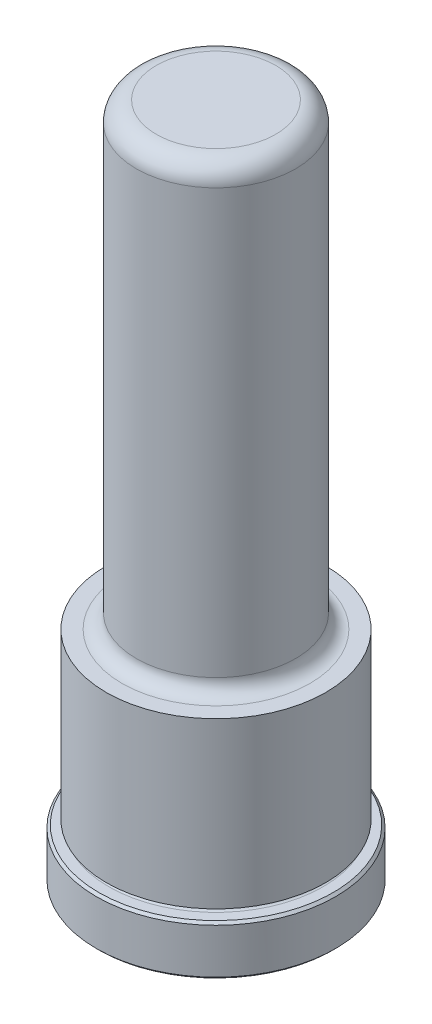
ISO-10303-21;
HEADER;
FILE_DESCRIPTION(('STEP AP214'),'2;1');
FILE_NAME('part.step','',(''),(''),'','','');
FILE_SCHEMA(('AUTOMOTIVE_DESIGN { 1 0 10303 214 1 1 1 1 }'));
ENDSEC;
DATA;
#1=APPLICATION_CONTEXT('core data for automotive mechanical design processes');
#2=APPLICATION_PROTOCOL_DEFINITION('international standard','automotive_design',2000,#1);
#3=PRODUCT_CONTEXT('',#1,'mechanical');
#4=PRODUCT('Part','Part','',(#3));
#5=PRODUCT_RELATED_PRODUCT_CATEGORY('part','',(#4));
#6=PRODUCT_DEFINITION_FORMATION('','',#4);
#7=PRODUCT_DEFINITION_CONTEXT('part definition',#1,'design');
#8=PRODUCT_DEFINITION('design','',#6,#7);
#9=PRODUCT_DEFINITION_SHAPE('','',#8);
#10=(LENGTH_UNIT() NAMED_UNIT(*) SI_UNIT(.MILLI.,.METRE.));
#11=(NAMED_UNIT(*) PLANE_ANGLE_UNIT() SI_UNIT($,.RADIAN.));
#12=(NAMED_UNIT(*) SI_UNIT($,.STERADIAN.) SOLID_ANGLE_UNIT());
#13=UNCERTAINTY_MEASURE_WITH_UNIT(LENGTH_MEASURE(1.E-05),#10,'distance_accuracy_value','');
#14=(GEOMETRIC_REPRESENTATION_CONTEXT(3) GLOBAL_UNCERTAINTY_ASSIGNED_CONTEXT((#13)) GLOBAL_UNIT_ASSIGNED_CONTEXT((#10,
#11,#12)) REPRESENTATION_CONTEXT('',''));
#15=CARTESIAN_POINT('',(0.,0.,0.));
#16=DIRECTION('',(0.,0.,1.));
#17=DIRECTION('',(1.,0.,0.));
#18=AXIS2_PLACEMENT_3D('',#15,#16,#17);
#19=CARTESIAN_POINT('',(0.,0.,0.));
#20=DIRECTION('',(0.,1.,0.));
#21=DIRECTION('',(0.,0.,1.));
#22=AXIS2_PLACEMENT_3D('',#19,#20,#21);
#23=PLANE('',#22);
#24=CARTESIAN_POINT('',(0.,0.,0.));
#25=DIRECTION('',(0.,1.,0.));
#26=DIRECTION('',(0.,0.,1.));
#27=AXIS2_PLACEMENT_3D('',#24,#25,#26);
#28=CIRCLE('',#27,18.669);
#29=CARTESIAN_POINT('',(0.,0.,18.669));
#30=VERTEX_POINT('',#29);
#31=EDGE_CURVE('E46',#30,#30,#28,.F.);
#32=ORIENTED_EDGE('',*,*,#31,.T.);
#33=EDGE_LOOP('',(#32));
#34=FACE_BOUND('',#33,.T.);
#35=ADVANCED_FACE('F31',(#34),#23,.F.);
#36=CARTESIAN_POINT('',(0.,0.,0.));
#37=DIRECTION('',(0.,1.,0.));
#38=DIRECTION('',(0.,0.,1.));
#39=AXIS2_PLACEMENT_3D('',#36,#37,#38);
#40=CYLINDRICAL_SURFACE('',#39,19.05);
#41=CARTESIAN_POINT('',(0.,0.380999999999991,0.));
#42=DIRECTION('',(0.,1.,0.));
#43=DIRECTION('',(0.,0.,1.));
#44=AXIS2_PLACEMENT_3D('',#41,#42,#43);
#45=CIRCLE('',#44,19.05);
#46=CARTESIAN_POINT('',(0.,0.380999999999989,19.05));
#47=VERTEX_POINT('',#46);
#48=EDGE_CURVE('E51',#47,#47,#45,.T.);
#49=ORIENTED_EDGE('',*,*,#48,.T.);
#50=EDGE_LOOP('',(#49));
#51=FACE_BOUND('',#50,.T.);
#52=CARTESIAN_POINT('',(0.,7.5438,0.));
#53=DIRECTION('',(0.,-1.,0.));
#54=DIRECTION('',(0.,0.,-1.));
#55=AXIS2_PLACEMENT_3D('',#52,#53,#54);
#56=CIRCLE('',#55,19.05);
#57=CARTESIAN_POINT('',(0.,7.5438,-19.05));
#58=VERTEX_POINT('',#57);
#59=EDGE_CURVE('E54',#58,#58,#56,.T.);
#60=ORIENTED_EDGE('',*,*,#59,.T.);
#61=EDGE_LOOP('',(#60));
#62=FACE_BOUND('',#61,.T.);
#63=ADVANCED_FACE('F110',(#51,#62),#40,.T.);
#64=CARTESIAN_POINT('',(0.,7.9248,-19.05));
#65=DIRECTION('',(0.,-1.,0.));
#66=DIRECTION('',(0.,0.,-1.));
#67=AXIS2_PLACEMENT_3D('',#64,#65,#66);
#68=PLANE('',#67);
#69=CARTESIAN_POINT('',(0.,7.9248,0.));
#70=DIRECTION('',(0.,-1.,0.));
#71=DIRECTION('',(0.,0.,-1.));
#72=AXIS2_PLACEMENT_3D('',#69,#70,#71);
#73=CIRCLE('',#72,18.669);
#74=CARTESIAN_POINT('',(0.,7.9248,-18.669));
#75=VERTEX_POINT('',#74);
#76=EDGE_CURVE('E42',#75,#75,#73,.F.);
#77=ORIENTED_EDGE('',*,*,#76,.T.);
#78=EDGE_LOOP('',(#77));
#79=FACE_BOUND('',#78,.T.);
#80=CARTESIAN_POINT('',(0.,7.9248,0.));
#81=DIRECTION('',(0.,1.,0.));
#82=DIRECTION('',(0.,0.,1.));
#83=AXIS2_PLACEMENT_3D('',#80,#81,#82);
#84=CIRCLE('',#83,17.0688);
#85=CARTESIAN_POINT('',(0.,7.92479999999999,17.0688));
#86=VERTEX_POINT('',#85);
#87=EDGE_CURVE('E57',#86,#86,#84,.T.);
#88=ORIENTED_EDGE('',*,*,#87,.F.);
#89=EDGE_LOOP('',(#88));
#90=FACE_BOUND('',#89,.T.);
#91=ADVANCED_FACE('F105',(#79,#90),#68,.F.);
#92=CARTESIAN_POINT('',(0.,8.3058,0.));
#93=DIRECTION('',(0.,1.,0.));
#94=DIRECTION('',(0.,0.,1.));
#95=AXIS2_PLACEMENT_3D('',#92,#93,#94);
#96=TOROIDAL_SURFACE('',#95,17.0688,0.381000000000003);
#97=CARTESIAN_POINT('',(0.,8.6868,0.));
#98=DIRECTION('',(0.,1.,0.));
#99=DIRECTION('',(0.,0.,1.));
#100=AXIS2_PLACEMENT_3D('',#97,#98,#99);
#101=CIRCLE('',#100,17.0688);
#102=CARTESIAN_POINT('',(0.,8.6868,17.0688));
#103=VERTEX_POINT('',#102);
#104=EDGE_CURVE('E60',#103,#103,#101,.T.);
#105=ORIENTED_EDGE('',*,*,#104,.F.);
#106=EDGE_LOOP('',(#105));
#107=FACE_BOUND('',#106,.T.);
#108=ORIENTED_EDGE('',*,*,#87,.T.);
#109=EDGE_LOOP('',(#108));
#110=FACE_BOUND('',#109,.T.);
#111=ADVANCED_FACE('F99',(#107,#110),#96,.F.);
#112=CARTESIAN_POINT('',(0.,8.6868,-17.0688));
#113=DIRECTION('',(0.,1.,0.));
#114=DIRECTION('',(0.,0.,1.));
#115=AXIS2_PLACEMENT_3D('',#112,#113,#114);
#116=PLANE('',#115);
#117=CARTESIAN_POINT('',(0.,8.6868,0.));
#118=DIRECTION('',(0.,1.,0.));
#119=DIRECTION('',(0.,0.,1.));
#120=AXIS2_PLACEMENT_3D('',#117,#118,#119);
#121=CIRCLE('',#120,17.4752);
#122=CARTESIAN_POINT('',(0.,8.6868,17.4752));
#123=VERTEX_POINT('',#122);
#124=EDGE_CURVE('E63',#123,#123,#121,.T.);
#125=ORIENTED_EDGE('',*,*,#124,.F.);
#126=EDGE_LOOP('',(#125));
#127=FACE_BOUND('',#126,.T.);
#128=ORIENTED_EDGE('',*,*,#104,.T.);
#129=EDGE_LOOP('',(#128));
#130=FACE_BOUND('',#129,.T.);
#131=ADVANCED_FACE('F93',(#127,#130),#116,.F.);
#132=CARTESIAN_POINT('',(0.,0.,0.));
#133=DIRECTION('',(0.,1.,0.));
#134=DIRECTION('',(0.,0.,1.));
#135=AXIS2_PLACEMENT_3D('',#132,#133,#134);
#136=CYLINDRICAL_SURFACE('',#135,17.4752);
#137=CARTESIAN_POINT('',(0.,34.925,0.));
#138=DIRECTION('',(0.,1.,0.));
#139=DIRECTION('',(0.,0.,1.));
#140=AXIS2_PLACEMENT_3D('',#137,#138,#139);
#141=CIRCLE('',#140,17.4752);
#142=CARTESIAN_POINT('',(0.,34.925,17.4752));
#143=VERTEX_POINT('',#142);
#144=EDGE_CURVE('E66',#143,#143,#141,.T.);
#145=ORIENTED_EDGE('',*,*,#144,.F.);
#146=EDGE_LOOP('',(#145));
#147=FACE_BOUND('',#146,.T.);
#148=ORIENTED_EDGE('',*,*,#124,.T.);
#149=EDGE_LOOP('',(#148));
#150=FACE_BOUND('',#149,.T.);
#151=ADVANCED_FACE('F87',(#147,#150),#136,.T.);
#152=CARTESIAN_POINT('',(0.,34.925,-17.4752));
#153=DIRECTION('',(0.,-1.,0.));
#154=DIRECTION('',(0.,0.,-1.));
#155=AXIS2_PLACEMENT_3D('',#152,#153,#154);
#156=PLANE('',#155);
#157=CARTESIAN_POINT('',(0.,34.925,0.));
#158=DIRECTION('',(0.,1.,0.));
#159=DIRECTION('',(0.,0.,1.));
#160=AXIS2_PLACEMENT_3D('',#157,#158,#159);
#161=CIRCLE('',#160,14.9733);
#162=CARTESIAN_POINT('',(0.,34.925,14.9733));
#163=VERTEX_POINT('',#162);
#164=EDGE_CURVE('E69',#163,#163,#161,.T.);
#165=ORIENTED_EDGE('',*,*,#164,.F.);
#166=EDGE_LOOP('',(#165));
#167=FACE_BOUND('',#166,.T.);
#168=ORIENTED_EDGE('',*,*,#144,.T.);
#169=EDGE_LOOP('',(#168));
#170=FACE_BOUND('',#169,.T.);
#171=ADVANCED_FACE('F81',(#167,#170),#156,.F.);
#172=CARTESIAN_POINT('',(0.,37.211,0.));
#173=DIRECTION('',(0.,1.,0.));
#174=DIRECTION('',(0.,0.,1.));
#175=AXIS2_PLACEMENT_3D('',#172,#173,#174);
#176=TOROIDAL_SURFACE('',#175,14.9733,2.286);
#177=CARTESIAN_POINT('',(0.,37.211,0.));
#178=DIRECTION('',(0.,1.,0.));
#179=DIRECTION('',(0.,0.,1.));
#180=AXIS2_PLACEMENT_3D('',#177,#178,#179);
#181=CIRCLE('',#180,12.6873);
#182=CARTESIAN_POINT('',(0.,37.211,12.6873));
#183=VERTEX_POINT('',#182);
#184=EDGE_CURVE('E72',#183,#183,#181,.T.);
#185=ORIENTED_EDGE('',*,*,#184,.F.);
#186=EDGE_LOOP('',(#185));
#187=FACE_BOUND('',#186,.T.);
#188=ORIENTED_EDGE('',*,*,#164,.T.);
#189=EDGE_LOOP('',(#188));
#190=FACE_BOUND('',#189,.T.);
#191=ADVANCED_FACE('F78',(#187,#190),#176,.F.);
#192=CARTESIAN_POINT('',(0.,0.,0.));
#193=DIRECTION('',(0.,1.,0.));
#194=DIRECTION('',(0.,0.,1.));
#195=AXIS2_PLACEMENT_3D('',#192,#193,#194);
#196=CYLINDRICAL_SURFACE('',#195,12.6873);
#197=CARTESIAN_POINT('',(0.,104.775,0.));
#198=DIRECTION('',(0.,-1.,0.));
#199=DIRECTION('',(0.,0.,-1.));
#200=AXIS2_PLACEMENT_3D('',#197,#198,#199);
#201=CIRCLE('',#200,12.6873);
#202=CARTESIAN_POINT('',(0.,104.775,-12.6873));
#203=VERTEX_POINT('',#202);
#204=EDGE_CURVE('E10',#203,#203,#201,.T.);
#205=ORIENTED_EDGE('',*,*,#204,.T.);
#206=EDGE_LOOP('',(#205));
#207=FACE_BOUND('',#206,.T.);
#208=ORIENTED_EDGE('',*,*,#184,.T.);
#209=EDGE_LOOP('',(#208));
#210=FACE_BOUND('',#209,.T.);
#211=ADVANCED_FACE('F76',(#207,#210),#196,.T.);
#212=CARTESIAN_POINT('',(0.,107.95,-12.6873));
#213=DIRECTION('',(0.,-1.,0.));
#214=DIRECTION('',(0.,0.,-1.));
#215=AXIS2_PLACEMENT_3D('',#212,#213,#214);
#216=PLANE('',#215);
#217=CARTESIAN_POINT('',(0.,107.95,0.));
#218=DIRECTION('',(0.,-1.,0.));
#219=DIRECTION('',(0.,0.,-1.));
#220=AXIS2_PLACEMENT_3D('',#217,#218,#219);
#221=CIRCLE('',#220,9.5123);
#222=CARTESIAN_POINT('',(0.,107.95,-9.51229999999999));
#223=VERTEX_POINT('',#222);
#224=EDGE_CURVE('E38',#223,#223,#221,.F.);
#225=ORIENTED_EDGE('',*,*,#224,.T.);
#226=EDGE_LOOP('',(#225));
#227=FACE_BOUND('',#226,.T.);
#228=ADVANCED_FACE('F127',(#227),#216,.F.);
#229=CARTESIAN_POINT('',(0.,0.380999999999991,0.));
#230=DIRECTION('',(0.,1.,0.));
#231=DIRECTION('',(0.,0.,1.));
#232=AXIS2_PLACEMENT_3D('',#229,#230,#231);
#233=CONICAL_SURFACE('',#232,19.05,0.785398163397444);
#234=CARTESIAN_POINT('',(0.,0.,18.669));
#235=CARTESIAN_POINT('',(0.,0.00396874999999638,18.67296875));
#236=CARTESIAN_POINT('',(0.,0.0079374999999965,18.6769375));
#237=CARTESIAN_POINT('',(0.,0.0158749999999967,18.684875));
#238=CARTESIAN_POINT('',(0.,0.0198437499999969,18.68884375));
#239=CARTESIAN_POINT('',(0.,0.0277812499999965,18.69678125));
#240=CARTESIAN_POINT('',(0.,0.031749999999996,18.70075));
#241=CARTESIAN_POINT('',(0.,0.0396874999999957,18.7086875));
#242=CARTESIAN_POINT('',(0.,0.0436562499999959,18.71265625));
#243=CARTESIAN_POINT('',(0.,0.0515937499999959,18.72059375));
#244=CARTESIAN_POINT('',(0.,0.0555624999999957,18.7245625));
#245=CARTESIAN_POINT('',(0.,0.0634999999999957,18.7325));
#246=CARTESIAN_POINT('',(0.,0.0674687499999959,18.73646875));
#247=CARTESIAN_POINT('',(0.,0.0754062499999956,18.74440625));
#248=CARTESIAN_POINT('',(0.,0.0793749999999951,18.748375));
#249=CARTESIAN_POINT('',(0.,0.0873124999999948,18.7563125));
#250=CARTESIAN_POINT('',(0.,0.0912812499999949,18.76028125));
#251=CARTESIAN_POINT('',(0.,0.099218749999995,18.76821875));
#252=CARTESIAN_POINT('',(0.,0.103187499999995,18.7721875));
#253=CARTESIAN_POINT('',(0.,0.111124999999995,18.780125));
#254=CARTESIAN_POINT('',(0.,0.115093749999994,18.78409375));
#255=CARTESIAN_POINT('',(0.,0.123031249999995,18.79203125));
#256=CARTESIAN_POINT('',(0.,0.126999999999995,18.796));
#257=CARTESIAN_POINT('',(0.,0.134937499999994,18.8039375));
#258=CARTESIAN_POINT('',(0.,0.138906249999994,18.80790625));
#259=CARTESIAN_POINT('',(0.,0.146843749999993,18.81584375));
#260=CARTESIAN_POINT('',(0.,0.150812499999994,18.8198125));
#261=CARTESIAN_POINT('',(0.,0.158749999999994,18.82775));
#262=CARTESIAN_POINT('',(0.,0.162718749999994,18.83171875));
#263=CARTESIAN_POINT('',(0.,0.170656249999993,18.83965625));
#264=CARTESIAN_POINT('',(0.,0.174624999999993,18.843625));
#265=CARTESIAN_POINT('',(0.,0.182562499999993,18.8515625));
#266=CARTESIAN_POINT('',(0.,0.186531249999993,18.85553125));
#267=CARTESIAN_POINT('',(0.,0.194468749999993,18.86346875));
#268=CARTESIAN_POINT('',(0.,0.198437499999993,18.8674375));
#269=CARTESIAN_POINT('',(0.,0.206374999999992,18.875375));
#270=CARTESIAN_POINT('',(0.,0.210343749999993,18.87934375));
#271=CARTESIAN_POINT('',(0.,0.218281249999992,18.88728125));
#272=CARTESIAN_POINT('',(0.,0.222249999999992,18.89125));
#273=CARTESIAN_POINT('',(0.,0.230187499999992,18.8991875));
#274=CARTESIAN_POINT('',(0.,0.234156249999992,18.90315625));
#275=CARTESIAN_POINT('',(0.,0.242093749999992,18.91109375));
#276=CARTESIAN_POINT('',(0.,0.246062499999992,18.9150625));
#277=CARTESIAN_POINT('',(0.,0.253999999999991,18.923));
#278=CARTESIAN_POINT('',(0.,0.257968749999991,18.92696875));
#279=CARTESIAN_POINT('',(0.,0.265906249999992,18.93490625));
#280=CARTESIAN_POINT('',(0.,0.269874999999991,18.938875));
#281=CARTESIAN_POINT('',(0.,0.277812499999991,18.9468125));
#282=CARTESIAN_POINT('',(0.,0.281781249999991,18.95078125));
#283=CARTESIAN_POINT('',(0.,0.289718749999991,18.95871875));
#284=CARTESIAN_POINT('',(0.,0.293687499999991,18.9626875));
#285=CARTESIAN_POINT('',(0.,0.301624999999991,18.970625));
#286=CARTESIAN_POINT('',(0.,0.30559374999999,18.97459375));
#287=CARTESIAN_POINT('',(0.,0.31353124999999,18.98253125));
#288=CARTESIAN_POINT('',(0.,0.31749999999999,18.9865));
#289=CARTESIAN_POINT('',(0.,0.32543749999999,18.9944375));
#290=CARTESIAN_POINT('',(0.,0.32940624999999,18.99840625));
#291=CARTESIAN_POINT('',(0.,0.33734374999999,19.00634375));
#292=CARTESIAN_POINT('',(0.,0.34131249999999,19.0103125));
#293=CARTESIAN_POINT('',(0.,0.34924999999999,19.01825));
#294=CARTESIAN_POINT('',(0.,0.353218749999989,19.02221875));
#295=CARTESIAN_POINT('',(0.,0.361156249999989,19.03015625));
#296=CARTESIAN_POINT('',(0.,0.365124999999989,19.034125));
#297=CARTESIAN_POINT('',(0.,0.37306249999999,19.0420625));
#298=CARTESIAN_POINT('',(0.,0.37703124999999,19.04603125));
#299=CARTESIAN_POINT('',(0.,0.380999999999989,19.05));
#300=B_SPLINE_CURVE_WITH_KNOTS('',3,(#234,#235,#236,#237,#238,#239,#240,#241,#242,#243,#244,
#245,#246,#247,#248,#249,#250,#251,#252,#253,#254,#255,#256,#257,#258,#259,#260,#261,#262,#263,
#264,#265,#266,#267,#268,#269,#270,#271,#272,#273,#274,#275,#276,#277,#278,#279,#280,#281,#282,
#283,#284,#285,#286,#287,#288,#289,#290,#291,#292,#293,#294,#295,#296,#297,#298,#299),
.UNSPECIFIED.,.F.,.F.,(4,2,2,2,2,2,2,2,2,2,2,2,2,2,2,2,2,2,2,2,2,2,2,2,2,2,2,2,2,2,2,2,4),(0.,
0.0168379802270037,0.0336759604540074,0.0505139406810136,0.0673519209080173,0.084189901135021,
0.101027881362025,0.117865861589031,0.134703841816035,0.151541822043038,0.168379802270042,
0.185217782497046,0.202055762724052,0.218893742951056,0.235731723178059,0.252569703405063,
0.269407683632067,0.286245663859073,0.303083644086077,0.31992162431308,0.336759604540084,
0.35359758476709,0.370435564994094,0.387273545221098,0.404111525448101,0.420949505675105,
0.437787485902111,0.454625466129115,0.471463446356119,0.488301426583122,0.505139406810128,
0.521977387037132,0.538815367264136),.UNSPECIFIED.);
#301=EDGE_CURVE('BSEAM124',#30,#47,#300,.T.);
#302=ORIENTED_EDGE('',*,*,#31,.F.);
#303=ORIENTED_EDGE('',*,*,#48,.F.);
#304=ORIENTED_EDGE('',*,*,#301,.T.);
#305=ORIENTED_EDGE('',*,*,#301,.F.);
#306=EDGE_LOOP('',(#302,#304,#303,#305));
#307=FACE_BOUND('',#306,.T.);
#308=ADVANCED_FACE('F124',(#307),#233,.T.);
#309=CARTESIAN_POINT('',(0.,7.9248,0.));
#310=DIRECTION('',(0.,-1.,0.));
#311=DIRECTION('',(0.,0.,-1.));
#312=AXIS2_PLACEMENT_3D('',#309,#310,#311);
#313=CONICAL_SURFACE('',#312,18.669,0.785398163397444);
#314=ORIENTED_EDGE('',*,*,#59,.F.);
#315=EDGE_LOOP('',(#314));
#316=FACE_BOUND('',#315,.T.);
#317=ORIENTED_EDGE('',*,*,#76,.F.);
#318=EDGE_LOOP('',(#317));
#319=FACE_BOUND('',#318,.T.);
#320=ADVANCED_FACE('F126',(#316,#319),#313,.T.);
#321=CARTESIAN_POINT('',(0.,104.775,0.));
#322=DIRECTION('',(0.,-1.,0.));
#323=DIRECTION('',(0.,0.,-1.));
#324=AXIS2_PLACEMENT_3D('',#321,#322,#323);
#325=TOROIDAL_SURFACE('',#324,9.5123,3.175);
#326=ORIENTED_EDGE('',*,*,#204,.F.);
#327=EDGE_LOOP('',(#326));
#328=FACE_BOUND('',#327,.T.);
#329=ORIENTED_EDGE('',*,*,#224,.F.);
#330=EDGE_LOOP('',(#329));
#331=FACE_BOUND('',#330,.T.);
#332=ADVANCED_FACE('F33',(#328,#331),#325,.T.);
#333=CLOSED_SHELL('',(#35,#63,#91,#111,#131,#151,#171,#191,#211,#228,#308,#320,#332));
#334=MANIFOLD_SOLID_BREP('B2',#333);
#335=ADVANCED_BREP_SHAPE_REPRESENTATION('',(#18,#334),#14);
#336=SHAPE_DEFINITION_REPRESENTATION(#9,#335);
ENDSEC;
END-ISO-10303-21;
